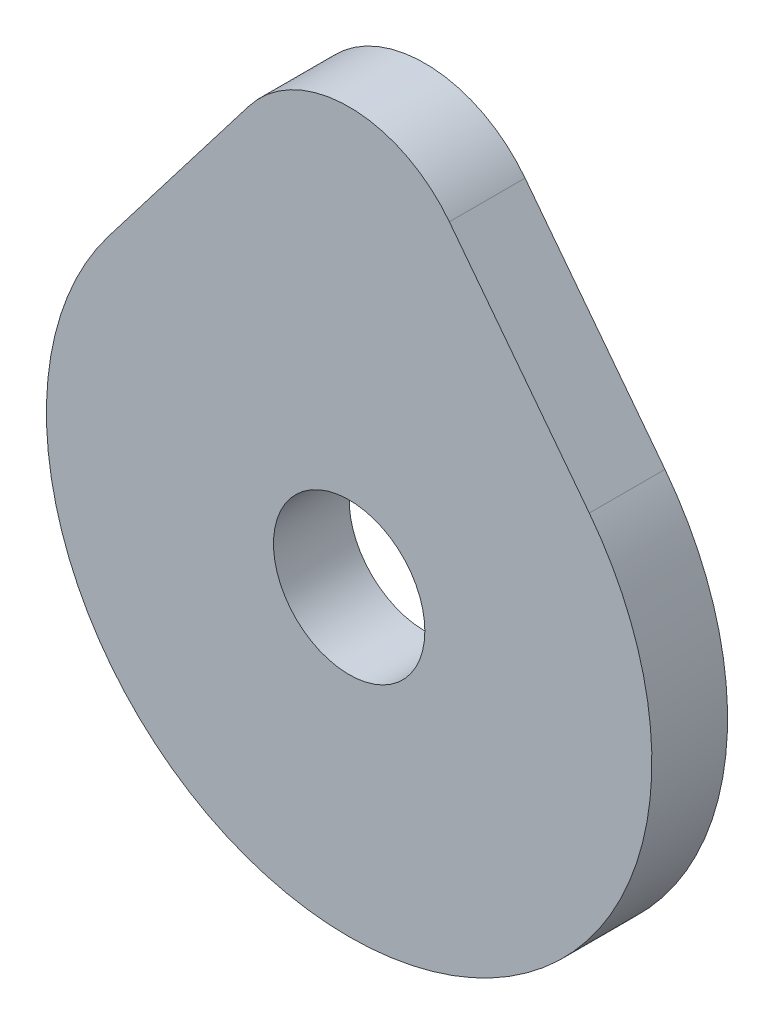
ISO-10303-21;
HEADER;
FILE_DESCRIPTION(('STEP AP214'),'2;1');
FILE_NAME('part.step','',(''),(''),'','','');
FILE_SCHEMA(('AUTOMOTIVE_DESIGN { 1 0 10303 214 1 1 1 1 }'));
ENDSEC;
DATA;
#1=APPLICATION_CONTEXT('core data for automotive mechanical design processes');
#2=APPLICATION_PROTOCOL_DEFINITION('international standard','automotive_design',2000,#1);
#3=PRODUCT_CONTEXT('',#1,'mechanical');
#4=PRODUCT('Part','Part','',(#3));
#5=PRODUCT_RELATED_PRODUCT_CATEGORY('part','',(#4));
#6=PRODUCT_DEFINITION_FORMATION('','',#4);
#7=PRODUCT_DEFINITION_CONTEXT('part definition',#1,'design');
#8=PRODUCT_DEFINITION('design','',#6,#7);
#9=PRODUCT_DEFINITION_SHAPE('','',#8);
#10=(LENGTH_UNIT() NAMED_UNIT(*) SI_UNIT(.MILLI.,.METRE.));
#11=(NAMED_UNIT(*) PLANE_ANGLE_UNIT() SI_UNIT($,.RADIAN.));
#12=(NAMED_UNIT(*) SI_UNIT($,.STERADIAN.) SOLID_ANGLE_UNIT());
#13=UNCERTAINTY_MEASURE_WITH_UNIT(LENGTH_MEASURE(1.E-05),#10,'distance_accuracy_value','');
#14=(GEOMETRIC_REPRESENTATION_CONTEXT(3) GLOBAL_UNCERTAINTY_ASSIGNED_CONTEXT((#13)) GLOBAL_UNIT_ASSIGNED_CONTEXT((#10,
#11,#12)) REPRESENTATION_CONTEXT('',''));
#15=CARTESIAN_POINT('',(0.,0.,0.));
#16=DIRECTION('',(0.,0.,1.));
#17=DIRECTION('',(1.,0.,0.));
#18=AXIS2_PLACEMENT_3D('',#15,#16,#17);
#19=CARTESIAN_POINT('',(0.,12.1541586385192,3.175));
#20=DIRECTION('',(0.,0.,1.));
#21=DIRECTION('',(1.,0.,0.));
#22=AXIS2_PLACEMENT_3D('',#19,#20,#21);
#23=PLANE('',#22);
#24=CARTESIAN_POINT('',(0.,12.1541586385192,3.175));
#25=DIRECTION('',(0.,0.,1.));
#26=DIRECTION('',(1.,0.,0.));
#27=AXIS2_PLACEMENT_3D('',#24,#25,#26);
#28=CIRCLE('',#27,5.29926324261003);
#29=CARTESIAN_POINT('',(4.20360134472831,15.3809103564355,3.175));
#30=VERTEX_POINT('',#29);
#31=CARTESIAN_POINT('',(-4.20360134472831,15.3809103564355,3.175));
#32=VERTEX_POINT('',#31);
#33=EDGE_CURVE('E85',#30,#32,#28,.T.);
#34=ORIENTED_EDGE('',*,*,#33,.T.);
#35=DIRECTION('',(-0.608905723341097,-0.793242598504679,0.));
#36=VECTOR('',#35,1.);
#37=CARTESIAN_POINT('',(-4.20360134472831,15.3809103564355,3.175));
#38=LINE('',#37,#36);
#39=CARTESIAN_POINT('',(-10.0741810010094,7.73310268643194,3.175));
#40=VERTEX_POINT('',#39);
#41=EDGE_CURVE('E80',#32,#40,#38,.T.);
#42=ORIENTED_EDGE('',*,*,#41,.T.);
#43=CARTESIAN_POINT('',(0.,0.,3.175));
#44=DIRECTION('',(0.,0.,1.));
#45=DIRECTION('',(1.,0.,0.));
#46=AXIS2_PLACEMENT_3D('',#43,#44,#45);
#47=CIRCLE('',#46,12.7);
#48=CARTESIAN_POINT('',(10.0741810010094,7.73310268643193,3.175));
#49=VERTEX_POINT('',#48);
#50=EDGE_CURVE('E83',#40,#49,#47,.T.);
#51=ORIENTED_EDGE('',*,*,#50,.T.);
#52=DIRECTION('',(-0.608905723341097,0.793242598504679,0.));
#53=VECTOR('',#52,1.);
#54=CARTESIAN_POINT('',(4.20360134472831,15.3809103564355,3.175));
#55=LINE('',#54,#53);
#56=EDGE_CURVE('E50',#49,#30,#55,.T.);
#57=ORIENTED_EDGE('',*,*,#56,.T.);
#58=EDGE_LOOP('',(#34,#42,#51,#57));
#59=FACE_BOUND('',#58,.T.);
#60=CARTESIAN_POINT('',(0.,0.,3.175));
#61=DIRECTION('',(0.,0.,1.));
#62=DIRECTION('',(1.,0.,0.));
#63=AXIS2_PLACEMENT_3D('',#60,#61,#62);
#64=CIRCLE('',#63,3.175);
#65=CARTESIAN_POINT('',(3.175,0.,3.175));
#66=VERTEX_POINT('',#65);
#67=EDGE_CURVE('E100',#66,#66,#64,.T.);
#68=ORIENTED_EDGE('',*,*,#67,.F.);
#69=EDGE_LOOP('',(#68));
#70=FACE_BOUND('',#69,.T.);
#71=ADVANCED_FACE('F33',(#59,#70),#23,.T.);
#72=CARTESIAN_POINT('',(0.,12.1541586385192,0.));
#73=DIRECTION('',(0.,0.,1.));
#74=DIRECTION('',(1.,0.,0.));
#75=AXIS2_PLACEMENT_3D('',#72,#73,#74);
#76=PLANE('',#75);
#77=CARTESIAN_POINT('',(0.,12.1541586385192,0.));
#78=DIRECTION('',(0.,0.,1.));
#79=DIRECTION('',(1.,0.,0.));
#80=AXIS2_PLACEMENT_3D('',#77,#78,#79);
#81=CIRCLE('',#80,5.29926324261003);
#82=CARTESIAN_POINT('',(4.20360134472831,15.3809103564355,0.));
#83=VERTEX_POINT('',#82);
#84=CARTESIAN_POINT('',(-4.20360134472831,15.3809103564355,0.));
#85=VERTEX_POINT('',#84);
#86=EDGE_CURVE('E97',#83,#85,#81,.T.);
#87=ORIENTED_EDGE('',*,*,#86,.F.);
#88=DIRECTION('',(-0.608905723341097,0.793242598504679,0.));
#89=VECTOR('',#88,1.);
#90=CARTESIAN_POINT('',(4.20360134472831,15.3809103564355,0.));
#91=LINE('',#90,#89);
#92=CARTESIAN_POINT('',(10.0741810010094,7.73310268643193,0.));
#93=VERTEX_POINT('',#92);
#94=EDGE_CURVE('E73',#93,#83,#91,.T.);
#95=ORIENTED_EDGE('',*,*,#94,.F.);
#96=CARTESIAN_POINT('',(0.,0.,0.));
#97=DIRECTION('',(0.,0.,1.));
#98=DIRECTION('',(1.,0.,0.));
#99=AXIS2_PLACEMENT_3D('',#96,#97,#98);
#100=CIRCLE('',#99,12.7);
#101=CARTESIAN_POINT('',(-10.0741810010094,7.73310268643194,0.));
#102=VERTEX_POINT('',#101);
#103=EDGE_CURVE('E67',#102,#93,#100,.T.);
#104=ORIENTED_EDGE('',*,*,#103,.F.);
#105=DIRECTION('',(-0.608905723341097,-0.793242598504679,0.));
#106=VECTOR('',#105,1.);
#107=CARTESIAN_POINT('',(-4.20360134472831,15.3809103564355,0.));
#108=LINE('',#107,#106);
#109=EDGE_CURVE('E89',#85,#102,#108,.T.);
#110=ORIENTED_EDGE('',*,*,#109,.F.);
#111=EDGE_LOOP('',(#87,#95,#104,#110));
#112=FACE_BOUND('',#111,.T.);
#113=CARTESIAN_POINT('',(0.,0.,0.));
#114=DIRECTION('',(0.,0.,1.));
#115=DIRECTION('',(1.,0.,0.));
#116=AXIS2_PLACEMENT_3D('',#113,#114,#115);
#117=CIRCLE('',#116,3.175);
#118=CARTESIAN_POINT('',(3.175,0.,0.));
#119=VERTEX_POINT('',#118);
#120=EDGE_CURVE('E112',#119,#119,#117,.T.);
#121=ORIENTED_EDGE('',*,*,#120,.T.);
#122=EDGE_LOOP('',(#121));
#123=FACE_BOUND('',#122,.T.);
#124=ADVANCED_FACE('F108',(#112,#123),#76,.F.);
#125=CARTESIAN_POINT('',(0.,12.1541586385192,3.175));
#126=DIRECTION('',(0.,0.,-1.));
#127=DIRECTION('',(-1.,0.,0.));
#128=AXIS2_PLACEMENT_3D('',#125,#126,#127);
#129=CYLINDRICAL_SURFACE('',#128,5.29926324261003);
#130=ORIENTED_EDGE('',*,*,#86,.T.);
#131=DIRECTION('',(0.,0.,-1.));
#132=VECTOR('',#131,1.);
#133=CARTESIAN_POINT('',(-4.20360134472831,15.3809103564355,3.175));
#134=LINE('',#133,#132);
#135=EDGE_CURVE('E11',#32,#85,#134,.T.);
#136=ORIENTED_EDGE('',*,*,#135,.F.);
#137=ORIENTED_EDGE('',*,*,#33,.F.);
#138=DIRECTION('',(0.,0.,-1.));
#139=VECTOR('',#138,1.);
#140=CARTESIAN_POINT('',(4.20360134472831,15.3809103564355,3.175));
#141=LINE('',#140,#139);
#142=EDGE_CURVE('E93',#30,#83,#141,.T.);
#143=ORIENTED_EDGE('',*,*,#142,.T.);
#144=EDGE_LOOP('',(#130,#136,#137,#143));
#145=FACE_BOUND('',#144,.T.);
#146=ADVANCED_FACE('F35',(#145),#129,.T.);
#147=CARTESIAN_POINT('',(-4.20360134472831,15.3809103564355,3.175));
#148=DIRECTION('',(0.793242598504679,-0.608905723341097,0.));
#149=DIRECTION('',(0.608905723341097,0.793242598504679,0.));
#150=AXIS2_PLACEMENT_3D('',#147,#148,#149);
#151=PLANE('',#150);
#152=ORIENTED_EDGE('',*,*,#109,.T.);
#153=DIRECTION('',(0.,0.,-1.));
#154=VECTOR('',#153,1.);
#155=CARTESIAN_POINT('',(-10.0741810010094,7.73310268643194,3.175));
#156=LINE('',#155,#154);
#157=EDGE_CURVE('E42',#40,#102,#156,.T.);
#158=ORIENTED_EDGE('',*,*,#157,.F.);
#159=ORIENTED_EDGE('',*,*,#41,.F.);
#160=ORIENTED_EDGE('',*,*,#135,.T.);
#161=EDGE_LOOP('',(#152,#158,#159,#160));
#162=FACE_BOUND('',#161,.T.);
#163=ADVANCED_FACE('F88',(#162),#151,.F.);
#164=CARTESIAN_POINT('',(0.,0.,3.175));
#165=DIRECTION('',(0.,0.,-1.));
#166=DIRECTION('',(-1.,0.,0.));
#167=AXIS2_PLACEMENT_3D('',#164,#165,#166);
#168=CYLINDRICAL_SURFACE('',#167,12.7);
#169=ORIENTED_EDGE('',*,*,#103,.T.);
#170=DIRECTION('',(0.,0.,-1.));
#171=VECTOR('',#170,1.);
#172=CARTESIAN_POINT('',(10.0741810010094,7.73310268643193,3.175));
#173=LINE('',#172,#171);
#174=EDGE_CURVE('E90',#49,#93,#173,.T.);
#175=ORIENTED_EDGE('',*,*,#174,.F.);
#176=ORIENTED_EDGE('',*,*,#50,.F.);
#177=ORIENTED_EDGE('',*,*,#157,.T.);
#178=EDGE_LOOP('',(#169,#175,#176,#177));
#179=FACE_BOUND('',#178,.T.);
#180=ADVANCED_FACE('F91',(#179),#168,.T.);
#181=CARTESIAN_POINT('',(4.20360134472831,15.3809103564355,3.175));
#182=DIRECTION('',(-0.793242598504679,-0.608905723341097,0.));
#183=DIRECTION('',(0.608905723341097,-0.793242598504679,0.));
#184=AXIS2_PLACEMENT_3D('',#181,#182,#183);
#185=PLANE('',#184);
#186=ORIENTED_EDGE('',*,*,#94,.T.);
#187=ORIENTED_EDGE('',*,*,#142,.F.);
#188=ORIENTED_EDGE('',*,*,#56,.F.);
#189=ORIENTED_EDGE('',*,*,#174,.T.);
#190=EDGE_LOOP('',(#186,#187,#188,#189));
#191=FACE_BOUND('',#190,.T.);
#192=ADVANCED_FACE('F105',(#191),#185,.F.);
#193=CARTESIAN_POINT('',(0.,0.,3.175));
#194=DIRECTION('',(0.,0.,-1.));
#195=DIRECTION('',(-1.,0.,0.));
#196=AXIS2_PLACEMENT_3D('',#193,#194,#195);
#197=CYLINDRICAL_SURFACE('',#196,3.175);
#198=ORIENTED_EDGE('',*,*,#67,.T.);
#199=EDGE_LOOP('',(#198));
#200=FACE_BOUND('',#199,.T.);
#201=ORIENTED_EDGE('',*,*,#120,.F.);
#202=EDGE_LOOP('',(#201));
#203=FACE_BOUND('',#202,.T.);
#204=ADVANCED_FACE('F118',(#200,#203),#197,.F.);
#205=CLOSED_SHELL('',(#71,#124,#146,#163,#180,#192,#204));
#206=MANIFOLD_SOLID_BREP('B2',#205);
#207=ADVANCED_BREP_SHAPE_REPRESENTATION('',(#18,#206),#14);
#208=SHAPE_DEFINITION_REPRESENTATION(#9,#207);
ENDSEC;
END-ISO-10303-21;
